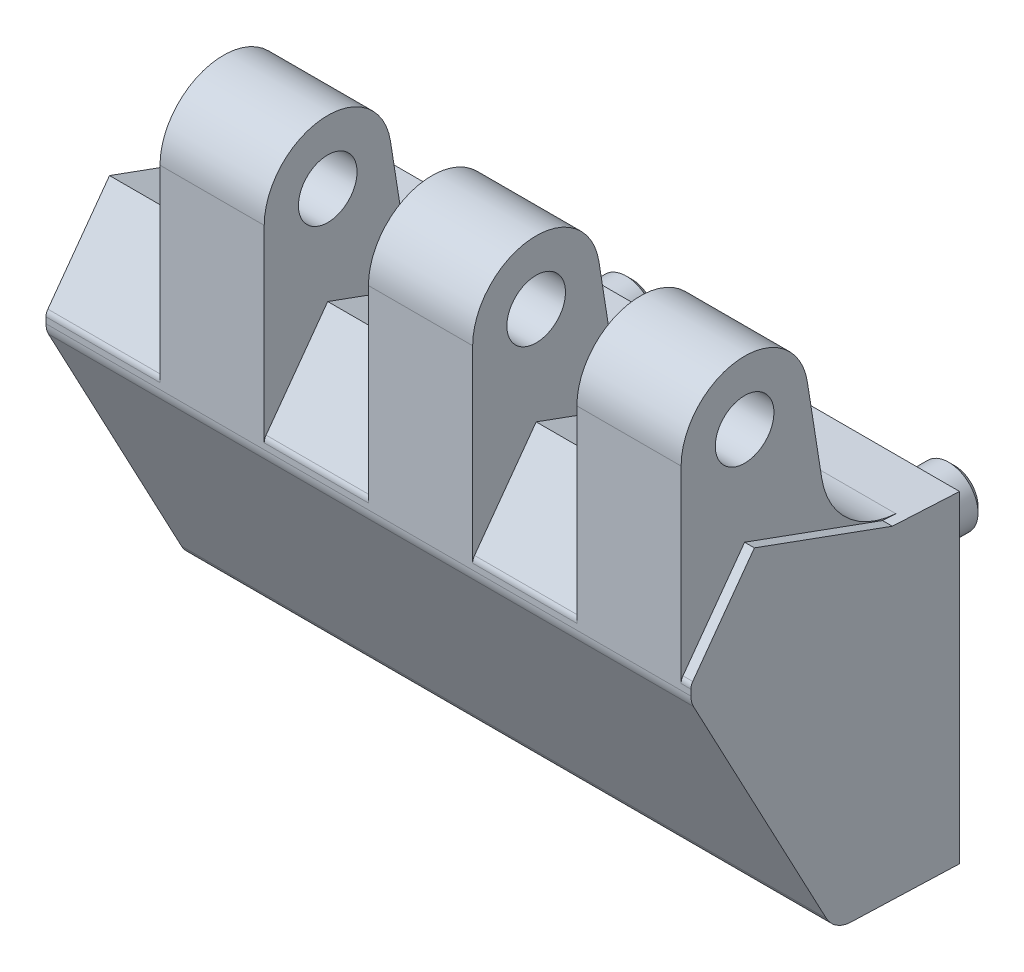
ISO-10303-21;
HEADER;
FILE_DESCRIPTION(('STEP AP214'),'2;1');
FILE_NAME('part.step','',(''),(''),'','','');
FILE_SCHEMA(('AUTOMOTIVE_DESIGN { 1 0 10303 214 1 1 1 1 }'));
ENDSEC;
DATA;
#1=APPLICATION_CONTEXT('core data for automotive mechanical design processes');
#2=APPLICATION_PROTOCOL_DEFINITION('international standard','automotive_design',2000,#1);
#3=PRODUCT_CONTEXT('',#1,'mechanical');
#4=PRODUCT('Part','Part','',(#3));
#5=PRODUCT_RELATED_PRODUCT_CATEGORY('part','',(#4));
#6=PRODUCT_DEFINITION_FORMATION('','',#4);
#7=PRODUCT_DEFINITION_CONTEXT('part definition',#1,'design');
#8=PRODUCT_DEFINITION('design','',#6,#7);
#9=PRODUCT_DEFINITION_SHAPE('','',#8);
#10=(LENGTH_UNIT() NAMED_UNIT(*) SI_UNIT(.MILLI.,.METRE.));
#11=(NAMED_UNIT(*) PLANE_ANGLE_UNIT() SI_UNIT($,.RADIAN.));
#12=(NAMED_UNIT(*) SI_UNIT($,.STERADIAN.) SOLID_ANGLE_UNIT());
#13=UNCERTAINTY_MEASURE_WITH_UNIT(LENGTH_MEASURE(1.E-05),#10,'distance_accuracy_value','');
#14=(GEOMETRIC_REPRESENTATION_CONTEXT(3) GLOBAL_UNCERTAINTY_ASSIGNED_CONTEXT((#13)) GLOBAL_UNIT_ASSIGNED_CONTEXT((#10,
#11,#12)) REPRESENTATION_CONTEXT('',''));
#15=CARTESIAN_POINT('',(0.,0.,0.));
#16=DIRECTION('',(0.,0.,1.));
#17=DIRECTION('',(1.,0.,0.));
#18=AXIS2_PLACEMENT_3D('',#15,#16,#17);
#19=CARTESIAN_POINT('',(-16.5,16.35,0.));
#20=DIRECTION('',(0.,0.998629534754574,-0.0523359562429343));
#21=DIRECTION('',(0.,0.0523359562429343,0.998629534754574));
#22=AXIS2_PLACEMENT_3D('',#19,#20,#21);
#23=PLANE('',#22);
#24=DIRECTION('',(-1.,0.,0.));
#25=VECTOR('',#24,1.);
#26=CARTESIAN_POINT('',(48.5,16.6393206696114,5.520567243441));
#27=LINE('',#26,#25);
#28=CARTESIAN_POINT('',(37.833333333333,16.6393206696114,5.52056724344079));
#29=VERTEX_POINT('',#28);
#30=CARTESIAN_POINT('',(48.5,16.6393206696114,5.520567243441));
#31=VERTEX_POINT('',#30);
#32=EDGE_CURVE('E29',#29,#31,#27,.F.);
#33=ORIENTED_EDGE('',*,*,#32,.T.);
#34=DIRECTION('',(0.,0.0523359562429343,0.998629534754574));
#35=VECTOR('',#34,1.);
#36=CARTESIAN_POINT('',(48.5,16.35,0.));
#37=LINE('',#36,#35);
#38=CARTESIAN_POINT('',(48.5,16.71068751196,6.8823277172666));
#39=VERTEX_POINT('',#38);
#40=EDGE_CURVE('E305',#31,#39,#37,.T.);
#41=ORIENTED_EDGE('',*,*,#40,.T.);
#42=DIRECTION('',(1.,0.,0.));
#43=VECTOR('',#42,1.);
#44=CARTESIAN_POINT('',(-16.5,16.71068751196,6.8823277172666));
#45=LINE('',#44,#43);
#46=CARTESIAN_POINT('',(49.5,16.71068751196,6.8823277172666));
#47=VERTEX_POINT('',#46);
#48=EDGE_CURVE('E508',#39,#47,#45,.T.);
#49=ORIENTED_EDGE('',*,*,#48,.T.);
#50=DIRECTION('',(0.,0.0523359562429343,0.998629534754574));
#51=VECTOR('',#50,1.);
#52=CARTESIAN_POINT('',(49.5,16.35,0.));
#53=LINE('',#52,#51);
#54=CARTESIAN_POINT('',(49.5,16.35,0.));
#55=VERTEX_POINT('',#54);
#56=EDGE_CURVE('E428',#55,#47,#53,.T.);
#57=ORIENTED_EDGE('',*,*,#56,.F.);
#58=DIRECTION('',(1.,0.,0.));
#59=VECTOR('',#58,1.);
#60=CARTESIAN_POINT('',(-16.5,16.35,0.));
#61=LINE('',#60,#59);
#62=CARTESIAN_POINT('',(-16.5,16.35,0.));
#63=VERTEX_POINT('',#62);
#64=EDGE_CURVE('E514',#63,#55,#61,.T.);
#65=ORIENTED_EDGE('',*,*,#64,.F.);
#66=DIRECTION('',(0.,0.0523359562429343,0.998629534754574));
#67=VECTOR('',#66,1.);
#68=CARTESIAN_POINT('',(-16.5,16.35,0.));
#69=LINE('',#68,#67);
#70=CARTESIAN_POINT('',(-16.5,16.71068751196,6.8823277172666));
#71=VERTEX_POINT('',#70);
#72=EDGE_CURVE('E458',#63,#71,#69,.T.);
#73=ORIENTED_EDGE('',*,*,#72,.T.);
#74=CARTESIAN_POINT('',(-4.833333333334,16.71068751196,6.8823277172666));
#75=VERTEX_POINT('',#74);
#76=EDGE_CURVE('E511',#71,#75,#45,.T.);
#77=ORIENTED_EDGE('',*,*,#76,.T.);
#78=DIRECTION('',(0.,0.0523359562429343,0.998629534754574));
#79=VECTOR('',#78,1.);
#80=CARTESIAN_POINT('',(-4.833333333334,16.35,0.));
#81=LINE('',#80,#79);
#82=CARTESIAN_POINT('',(-4.833333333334,16.6393206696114,5.52056724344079));
#83=VERTEX_POINT('',#82);
#84=EDGE_CURVE('E364',#83,#75,#81,.T.);
#85=ORIENTED_EDGE('',*,*,#84,.F.);
#86=DIRECTION('',(1.,0.,0.));
#87=VECTOR('',#86,1.);
#88=CARTESIAN_POINT('',(-4.833333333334,16.6393206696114,5.520567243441));
#89=LINE('',#88,#87);
#90=CARTESIAN_POINT('',(5.833333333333,16.6393206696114,5.52056724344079));
#91=VERTEX_POINT('',#90);
#92=EDGE_CURVE('E522',#91,#83,#89,.F.);
#93=ORIENTED_EDGE('',*,*,#92,.F.);
#94=DIRECTION('',(0.,0.0523359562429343,0.998629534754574));
#95=VECTOR('',#94,1.);
#96=CARTESIAN_POINT('',(5.833333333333,16.35,0.));
#97=LINE('',#96,#95);
#98=CARTESIAN_POINT('',(5.833333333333,16.71068751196,6.8823277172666));
#99=VERTEX_POINT('',#98);
#100=EDGE_CURVE('E355',#91,#99,#97,.T.);
#101=ORIENTED_EDGE('',*,*,#100,.T.);
#102=CARTESIAN_POINT('',(16.5,16.71068751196,6.8823277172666));
#103=VERTEX_POINT('',#102);
#104=EDGE_CURVE('E515',#99,#103,#45,.T.);
#105=ORIENTED_EDGE('',*,*,#104,.T.);
#106=DIRECTION('',(0.,0.0523359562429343,0.998629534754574));
#107=VECTOR('',#106,1.);
#108=CARTESIAN_POINT('',(16.5,16.35,0.));
#109=LINE('',#108,#107);
#110=CARTESIAN_POINT('',(16.5,16.6393206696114,5.52056724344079));
#111=VERTEX_POINT('',#110);
#112=EDGE_CURVE('E413',#111,#103,#109,.T.);
#113=ORIENTED_EDGE('',*,*,#112,.F.);
#114=DIRECTION('',(-1.,0.,0.));
#115=VECTOR('',#114,1.);
#116=CARTESIAN_POINT('',(27.166666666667,16.6393206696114,5.520567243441));
#117=LINE('',#116,#115);
#118=CARTESIAN_POINT('',(27.166666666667,16.6393206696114,5.520567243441));
#119=VERTEX_POINT('',#118);
#120=EDGE_CURVE('E520',#111,#119,#117,.F.);
#121=ORIENTED_EDGE('',*,*,#120,.T.);
#122=DIRECTION('',(0.,0.0523359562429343,0.998629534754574));
#123=VECTOR('',#122,1.);
#124=CARTESIAN_POINT('',(27.166666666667,16.35,0.));
#125=LINE('',#124,#123);
#126=CARTESIAN_POINT('',(27.166666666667,16.71068751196,6.8823277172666));
#127=VERTEX_POINT('',#126);
#128=EDGE_CURVE('E422',#119,#127,#125,.T.);
#129=ORIENTED_EDGE('',*,*,#128,.T.);
#130=CARTESIAN_POINT('',(37.833333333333,16.71068751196,6.8823277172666));
#131=VERTEX_POINT('',#130);
#132=EDGE_CURVE('E516',#127,#131,#45,.T.);
#133=ORIENTED_EDGE('',*,*,#132,.T.);
#134=DIRECTION('',(0.,0.0523359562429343,0.998629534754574));
#135=VECTOR('',#134,1.);
#136=CARTESIAN_POINT('',(37.833333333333,16.35,0.));
#137=LINE('',#136,#135);
#138=EDGE_CURVE('E34',#29,#131,#137,.T.);
#139=ORIENTED_EDGE('',*,*,#138,.F.);
#140=EDGE_LOOP('',(#33,#41,#49,#57,#65,#73,#77,#85,#93,#101,#105,#113,#121,#129,#133,#139));
#141=FACE_BOUND('',#140,.T.);
#142=ADVANCED_FACE('F14',(#141),#23,.T.);
#143=CARTESIAN_POINT('',(-16.5,16.71068751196,6.8823277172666));
#144=DIRECTION('',(0.,0.939692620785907,-0.342020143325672));
#145=DIRECTION('',(0.,0.342020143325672,0.939692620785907));
#146=AXIS2_PLACEMENT_3D('',#143,#144,#145);
#147=PLANE('',#146);
#148=ORIENTED_EDGE('',*,*,#48,.F.);
#149=DIRECTION('',(0.,0.342020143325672,0.939692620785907));
#150=VECTOR('',#149,1.);
#151=CARTESIAN_POINT('',(48.5,16.71068751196,6.8823277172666));
#152=LINE('',#151,#150);
#153=CARTESIAN_POINT('',(48.5,21.8491,21.));
#154=VERTEX_POINT('',#153);
#155=EDGE_CURVE('E303',#39,#154,#152,.T.);
#156=ORIENTED_EDGE('',*,*,#155,.T.);
#157=DIRECTION('',(1.,0.,0.));
#158=VECTOR('',#157,1.);
#159=CARTESIAN_POINT('',(-16.5,21.8491,21.));
#160=LINE('',#159,#158);
#161=CARTESIAN_POINT('',(49.5,21.8491,21.));
#162=VERTEX_POINT('',#161);
#163=EDGE_CURVE('E502',#154,#162,#160,.T.);
#164=ORIENTED_EDGE('',*,*,#163,.T.);
#165=DIRECTION('',(0.,0.342020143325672,0.939692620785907));
#166=VECTOR('',#165,1.);
#167=CARTESIAN_POINT('',(49.5,16.71068751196,6.8823277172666));
#168=LINE('',#167,#166);
#169=EDGE_CURVE('E431',#47,#162,#168,.T.);
#170=ORIENTED_EDGE('',*,*,#169,.F.);
#171=EDGE_LOOP('',(#148,#156,#164,#170));
#172=FACE_BOUND('',#171,.T.);
#173=ADVANCED_FACE('F625',(#172),#147,.T.);
#174=CARTESIAN_POINT('',(-16.5,21.8491,21.));
#175=DIRECTION('',(0.,0.587785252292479,0.809016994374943));
#176=DIRECTION('',(0.,-0.809016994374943,0.587785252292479));
#177=AXIS2_PLACEMENT_3D('',#174,#175,#176);
#178=PLANE('',#177);
#179=ORIENTED_EDGE('',*,*,#163,.F.);
#180=DIRECTION('',(0.,-0.809016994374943,0.587785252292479));
#181=VECTOR('',#180,1.);
#182=CARTESIAN_POINT('',(48.5,21.8491,21.));
#183=LINE('',#182,#181);
#184=CARTESIAN_POINT('',(48.5,13.165483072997,27.309016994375));
#185=VERTEX_POINT('',#184);
#186=EDGE_CURVE('E301',#154,#185,#183,.T.);
#187=ORIENTED_EDGE('',*,*,#186,.T.);
#188=DIRECTION('',(1.,0.,0.));
#189=VECTOR('',#188,1.);
#190=CARTESIAN_POINT('',(-16.5,13.165483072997,27.309016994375));
#191=LINE('',#190,#189);
#192=CARTESIAN_POINT('',(49.5,13.165483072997,27.309016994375));
#193=VERTEX_POINT('',#192);
#194=EDGE_CURVE('E496',#185,#193,#191,.T.);
#195=ORIENTED_EDGE('',*,*,#194,.T.);
#196=DIRECTION('',(0.,-0.809016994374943,0.587785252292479));
#197=VECTOR('',#196,1.);
#198=CARTESIAN_POINT('',(49.5,21.8491,21.));
#199=LINE('',#198,#197);
#200=EDGE_CURVE('E434',#162,#193,#199,.T.);
#201=ORIENTED_EDGE('',*,*,#200,.F.);
#202=EDGE_LOOP('',(#179,#187,#195,#201));
#203=FACE_BOUND('',#202,.T.);
#204=ADVANCED_FACE('F590',(#203),#178,.T.);
#205=CARTESIAN_POINT('',(-16.5,12.5776978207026,26.4999999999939));
#206=DIRECTION('',(1.,0.,0.));
#207=DIRECTION('',(0.,1.,0.));
#208=AXIS2_PLACEMENT_3D('',#205,#206,#207);
#209=CYLINDRICAL_SURFACE('',#208,1.0000000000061);
#210=ORIENTED_EDGE('',*,*,#194,.F.);
#211=CARTESIAN_POINT('',(48.5,12.5776978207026,26.4999999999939));
#212=DIRECTION('',(-1.,0.,0.));
#213=DIRECTION('',(0.,-1.,0.));
#214=AXIS2_PLACEMENT_3D('',#211,#212,#213);
#215=CIRCLE('',#214,1.0000000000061);
#216=CARTESIAN_POINT('',(48.5,12.577697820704,27.5));
#217=VERTEX_POINT('',#216);
#218=EDGE_CURVE('E299',#185,#217,#215,.F.);
#219=ORIENTED_EDGE('',*,*,#218,.T.);
#220=DIRECTION('',(1.,0.,0.));
#221=VECTOR('',#220,1.);
#222=CARTESIAN_POINT('',(-16.5,12.577697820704,27.5));
#223=LINE('',#222,#221);
#224=CARTESIAN_POINT('',(49.5,12.577697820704,27.5));
#225=VERTEX_POINT('',#224);
#226=EDGE_CURVE('E492',#217,#225,#223,.T.);
#227=ORIENTED_EDGE('',*,*,#226,.T.);
#228=CARTESIAN_POINT('',(49.5,12.5776978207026,26.4999999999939));
#229=DIRECTION('',(1.,0.,0.));
#230=DIRECTION('',(0.,1.,0.));
#231=AXIS2_PLACEMENT_3D('',#228,#229,#230);
#232=CIRCLE('',#231,1.0000000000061);
#233=EDGE_CURVE('E437',#193,#225,#232,.T.);
#234=ORIENTED_EDGE('',*,*,#233,.F.);
#235=EDGE_LOOP('',(#210,#219,#227,#234));
#236=FACE_BOUND('',#235,.T.);
#237=ADVANCED_FACE('F596',(#236),#209,.T.);
#238=ORIENTED_EDGE('',*,*,#104,.F.);
#239=DIRECTION('',(0.,0.342020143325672,0.939692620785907));
#240=VECTOR('',#239,1.);
#241=CARTESIAN_POINT('',(5.833333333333,16.71068751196,6.8823277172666));
#242=LINE('',#241,#240);
#243=CARTESIAN_POINT('',(5.833333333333,21.8491,21.));
#244=VERTEX_POINT('',#243);
#245=EDGE_CURVE('E352',#99,#244,#242,.T.);
#246=ORIENTED_EDGE('',*,*,#245,.T.);
#247=CARTESIAN_POINT('',(16.5,21.8491,21.));
#248=VERTEX_POINT('',#247);
#249=EDGE_CURVE('E509',#244,#248,#160,.T.);
#250=ORIENTED_EDGE('',*,*,#249,.T.);
#251=DIRECTION('',(0.,0.342020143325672,0.939692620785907));
#252=VECTOR('',#251,1.);
#253=CARTESIAN_POINT('',(16.5,16.71068751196,6.8823277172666));
#254=LINE('',#253,#252);
#255=EDGE_CURVE('E410',#103,#248,#254,.T.);
#256=ORIENTED_EDGE('',*,*,#255,.F.);
#257=EDGE_LOOP('',(#238,#246,#250,#256));
#258=FACE_BOUND('',#257,.T.);
#259=ADVANCED_FACE('F550',(#258),#147,.T.);
#260=ORIENTED_EDGE('',*,*,#249,.F.);
#261=DIRECTION('',(0.,-0.809016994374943,0.587785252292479));
#262=VECTOR('',#261,1.);
#263=CARTESIAN_POINT('',(5.833333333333,21.8491,21.));
#264=LINE('',#263,#262);
#265=CARTESIAN_POINT('',(5.833333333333,13.165483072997,27.309016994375));
#266=VERTEX_POINT('',#265);
#267=EDGE_CURVE('E349',#244,#266,#264,.T.);
#268=ORIENTED_EDGE('',*,*,#267,.T.);
#269=CARTESIAN_POINT('',(16.5,13.165483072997,27.309016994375));
#270=VERTEX_POINT('',#269);
#271=EDGE_CURVE('E503',#266,#270,#191,.T.);
#272=ORIENTED_EDGE('',*,*,#271,.T.);
#273=DIRECTION('',(0.,-0.809016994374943,0.587785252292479));
#274=VECTOR('',#273,1.);
#275=CARTESIAN_POINT('',(16.5,21.8491,21.));
#276=LINE('',#275,#274);
#277=EDGE_CURVE('E407',#248,#270,#276,.T.);
#278=ORIENTED_EDGE('',*,*,#277,.F.);
#279=EDGE_LOOP('',(#260,#268,#272,#278));
#280=FACE_BOUND('',#279,.T.);
#281=ADVANCED_FACE('F1048',(#280),#178,.T.);
#282=ORIENTED_EDGE('',*,*,#271,.F.);
#283=CARTESIAN_POINT('',(5.833333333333,12.5776978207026,26.4999999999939));
#284=DIRECTION('',(-1.,0.,0.));
#285=DIRECTION('',(0.,-1.,0.));
#286=AXIS2_PLACEMENT_3D('',#283,#284,#285);
#287=CIRCLE('',#286,1.0000000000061);
#288=CARTESIAN_POINT('',(5.833333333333,12.577697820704,27.5));
#289=VERTEX_POINT('',#288);
#290=EDGE_CURVE('E346',#266,#289,#287,.F.);
#291=ORIENTED_EDGE('',*,*,#290,.T.);
#292=CARTESIAN_POINT('',(16.5,12.577697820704,27.5));
#293=VERTEX_POINT('',#292);
#294=EDGE_CURVE('E497',#289,#293,#223,.T.);
#295=ORIENTED_EDGE('',*,*,#294,.T.);
#296=CARTESIAN_POINT('',(16.5,12.5776978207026,26.4999999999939));
#297=DIRECTION('',(-1.,0.,0.));
#298=DIRECTION('',(0.,-1.,0.));
#299=AXIS2_PLACEMENT_3D('',#296,#297,#298);
#300=CIRCLE('',#299,1.0000000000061);
#301=EDGE_CURVE('E404',#270,#293,#300,.F.);
#302=ORIENTED_EDGE('',*,*,#301,.F.);
#303=EDGE_LOOP('',(#282,#291,#295,#302));
#304=FACE_BOUND('',#303,.T.);
#305=ADVANCED_FACE('F604',(#304),#209,.T.);
#306=DIRECTION('',(0.,0.342020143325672,0.939692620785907));
#307=VECTOR('',#306,1.);
#308=CARTESIAN_POINT('',(37.833333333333,16.71068751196,6.8823277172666));
#309=LINE('',#308,#307);
#310=CARTESIAN_POINT('',(37.833333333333,21.8491,21.));
#311=VERTEX_POINT('',#310);
#312=EDGE_CURVE('E295',#131,#311,#309,.T.);
#313=ORIENTED_EDGE('',*,*,#312,.F.);
#314=ORIENTED_EDGE('',*,*,#132,.F.);
#315=DIRECTION('',(0.,0.342020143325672,0.939692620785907));
#316=VECTOR('',#315,1.);
#317=CARTESIAN_POINT('',(27.166666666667,16.71068751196,6.8823277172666));
#318=LINE('',#317,#316);
#319=CARTESIAN_POINT('',(27.166666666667,21.8491,21.));
#320=VERTEX_POINT('',#319);
#321=EDGE_CURVE('E420',#127,#320,#318,.T.);
#322=ORIENTED_EDGE('',*,*,#321,.T.);
#323=EDGE_CURVE('E510',#320,#311,#160,.T.);
#324=ORIENTED_EDGE('',*,*,#323,.T.);
#325=EDGE_LOOP('',(#313,#314,#322,#324));
#326=FACE_BOUND('',#325,.T.);
#327=ADVANCED_FACE('F577',(#326),#147,.T.);
#328=DIRECTION('',(0.,-0.809016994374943,0.587785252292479));
#329=VECTOR('',#328,1.);
#330=CARTESIAN_POINT('',(37.833333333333,21.8491,21.));
#331=LINE('',#330,#329);
#332=CARTESIAN_POINT('',(37.833333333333,13.165483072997,27.309016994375));
#333=VERTEX_POINT('',#332);
#334=EDGE_CURVE('E292',#311,#333,#331,.T.);
#335=ORIENTED_EDGE('',*,*,#334,.F.);
#336=ORIENTED_EDGE('',*,*,#323,.F.);
#337=DIRECTION('',(0.,-0.809016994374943,0.587785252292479));
#338=VECTOR('',#337,1.);
#339=CARTESIAN_POINT('',(27.166666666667,21.8491,21.));
#340=LINE('',#339,#338);
#341=CARTESIAN_POINT('',(27.166666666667,13.165483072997,27.309016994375));
#342=VERTEX_POINT('',#341);
#343=EDGE_CURVE('E418',#320,#342,#340,.T.);
#344=ORIENTED_EDGE('',*,*,#343,.T.);
#345=EDGE_CURVE('E504',#342,#333,#191,.T.);
#346=ORIENTED_EDGE('',*,*,#345,.T.);
#347=EDGE_LOOP('',(#335,#336,#344,#346));
#348=FACE_BOUND('',#347,.T.);
#349=ADVANCED_FACE('F582',(#348),#178,.T.);
#350=CARTESIAN_POINT('',(37.833333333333,12.5776978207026,26.4999999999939));
#351=DIRECTION('',(-1.,0.,0.));
#352=DIRECTION('',(0.,-1.,0.));
#353=AXIS2_PLACEMENT_3D('',#350,#351,#352);
#354=CIRCLE('',#353,1.0000000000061);
#355=CARTESIAN_POINT('',(37.833333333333,12.577697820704,27.5));
#356=VERTEX_POINT('',#355);
#357=EDGE_CURVE('E251',#333,#356,#354,.F.);
#358=ORIENTED_EDGE('',*,*,#357,.F.);
#359=ORIENTED_EDGE('',*,*,#345,.F.);
#360=CARTESIAN_POINT('',(27.166666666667,12.5776978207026,26.4999999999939));
#361=DIRECTION('',(-1.,0.,0.));
#362=DIRECTION('',(0.,-1.,0.));
#363=AXIS2_PLACEMENT_3D('',#360,#361,#362);
#364=CIRCLE('',#363,1.0000000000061);
#365=CARTESIAN_POINT('',(27.166666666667,12.577697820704,27.5));
#366=VERTEX_POINT('',#365);
#367=EDGE_CURVE('E416',#342,#366,#364,.F.);
#368=ORIENTED_EDGE('',*,*,#367,.T.);
#369=EDGE_CURVE('E498',#366,#356,#223,.T.);
#370=ORIENTED_EDGE('',*,*,#369,.T.);
#371=EDGE_LOOP('',(#358,#359,#368,#370));
#372=FACE_BOUND('',#371,.T.);
#373=ADVANCED_FACE('F643',(#372),#209,.T.);
#374=CARTESIAN_POINT('',(-16.5,-16.262685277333,11.091242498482));
#375=DIRECTION('',(0.,-0.999390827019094,0.0348994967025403));
#376=DIRECTION('',(0.,-0.0348994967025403,-0.999390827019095));
#377=AXIS2_PLACEMENT_3D('',#374,#375,#376);
#378=PLANE('',#377);
#379=DIRECTION('',(1.,0.,0.));
#380=VECTOR('',#379,1.);
#381=CARTESIAN_POINT('',(-16.5,-16.65,0.));
#382=LINE('',#381,#380);
#383=CARTESIAN_POINT('',(-16.5,-16.65,0.));
#384=VERTEX_POINT('',#383);
#385=CARTESIAN_POINT('',(49.5,-16.65,0.));
#386=VERTEX_POINT('',#385);
#387=EDGE_CURVE('E518',#384,#386,#382,.T.);
#388=ORIENTED_EDGE('',*,*,#387,.T.);
#389=DIRECTION('',(0.,-0.0348994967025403,-0.999390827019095));
#390=VECTOR('',#389,1.);
#391=CARTESIAN_POINT('',(49.5,-16.262685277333,11.091242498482));
#392=LINE('',#391,#390);
#393=CARTESIAN_POINT('',(49.5,-16.262685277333,11.091242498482));
#394=VERTEX_POINT('',#393);
#395=EDGE_CURVE('E424',#394,#386,#392,.T.);
#396=ORIENTED_EDGE('',*,*,#395,.F.);
#397=DIRECTION('',(1.,0.,0.));
#398=VECTOR('',#397,1.);
#399=CARTESIAN_POINT('',(-16.5,-16.262685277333,11.091242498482));
#400=LINE('',#399,#398);
#401=CARTESIAN_POINT('',(-16.5,-16.262685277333,11.091242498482));
#402=VERTEX_POINT('',#401);
#403=EDGE_CURVE('E482',#402,#394,#400,.T.);
#404=ORIENTED_EDGE('',*,*,#403,.F.);
#405=DIRECTION('',(0.,-0.0348994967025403,-0.999390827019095));
#406=VECTOR('',#405,1.);
#407=CARTESIAN_POINT('',(-16.5,-16.262685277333,11.091242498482));
#408=LINE('',#407,#406);
#409=EDGE_CURVE('E452',#402,#384,#408,.T.);
#410=ORIENTED_EDGE('',*,*,#409,.T.);
#411=EDGE_LOOP('',(#388,#396,#404,#410));
#412=FACE_BOUND('',#411,.T.);
#413=ADVANCED_FACE('F16',(#412),#378,.T.);
#414=CARTESIAN_POINT('',(-16.5,-16.65,0.));
#415=DIRECTION('',(0.,0.,-1.));
#416=DIRECTION('',(-1.,0.,0.));
#417=AXIS2_PLACEMENT_3D('',#414,#415,#416);
#418=PLANE('',#417);
#419=CARTESIAN_POINT('',(0.,0.,0.));
#420=DIRECTION('',(0.,0.,-1.));
#421=DIRECTION('',(-1.,0.,0.));
#422=AXIS2_PLACEMENT_3D('',#419,#420,#421);
#423=CIRCLE('',#422,3.);
#424=CARTESIAN_POINT('',(-3.,0.,0.));
#425=VERTEX_POINT('',#424);
#426=EDGE_CURVE('E9',#425,#425,#423,.T.);
#427=ORIENTED_EDGE('',*,*,#426,.F.);
#428=EDGE_LOOP('',(#427));
#429=FACE_BOUND('',#428,.T.);
#430=CARTESIAN_POINT('',(33.,0.,0.));
#431=DIRECTION('',(0.,0.,-1.));
#432=DIRECTION('',(-1.,0.,0.));
#433=AXIS2_PLACEMENT_3D('',#430,#431,#432);
#434=CIRCLE('',#433,3.);
#435=CARTESIAN_POINT('',(30.,0.,0.));
#436=VERTEX_POINT('',#435);
#437=EDGE_CURVE('E22',#436,#436,#434,.T.);
#438=ORIENTED_EDGE('',*,*,#437,.F.);
#439=EDGE_LOOP('',(#438));
#440=FACE_BOUND('',#439,.T.);
#441=ORIENTED_EDGE('',*,*,#64,.T.);
#442=DIRECTION('',(0.,1.,0.));
#443=VECTOR('',#442,1.);
#444=CARTESIAN_POINT('',(49.5,-16.65,0.));
#445=LINE('',#444,#443);
#446=EDGE_CURVE('E425',#386,#55,#445,.T.);
#447=ORIENTED_EDGE('',*,*,#446,.F.);
#448=ORIENTED_EDGE('',*,*,#387,.F.);
#449=DIRECTION('',(0.,1.,0.));
#450=VECTOR('',#449,1.);
#451=CARTESIAN_POINT('',(-16.5,-16.65,0.));
#452=LINE('',#451,#450);
#453=EDGE_CURVE('E455',#384,#63,#452,.T.);
#454=ORIENTED_EDGE('',*,*,#453,.T.);
#455=EDGE_LOOP('',(#441,#447,#448,#454));
#456=FACE_BOUND('',#455,.T.);
#457=ADVANCED_FACE('F529',(#429,#440,#456),#418,.T.);
#458=DIRECTION('',(0.,0.342020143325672,0.939692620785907));
#459=VECTOR('',#458,1.);
#460=CARTESIAN_POINT('',(-4.833333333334,16.71068751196,6.8823277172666));
#461=LINE('',#460,#459);
#462=CARTESIAN_POINT('',(-4.833333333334,21.8491,21.));
#463=VERTEX_POINT('',#462);
#464=EDGE_CURVE('E362',#75,#463,#461,.T.);
#465=ORIENTED_EDGE('',*,*,#464,.F.);
#466=ORIENTED_EDGE('',*,*,#76,.F.);
#467=DIRECTION('',(0.,0.342020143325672,0.939692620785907));
#468=VECTOR('',#467,1.);
#469=CARTESIAN_POINT('',(-16.5,16.71068751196,6.8823277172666));
#470=LINE('',#469,#468);
#471=CARTESIAN_POINT('',(-16.5,21.8491,21.));
#472=VERTEX_POINT('',#471);
#473=EDGE_CURVE('E461',#71,#472,#470,.T.);
#474=ORIENTED_EDGE('',*,*,#473,.T.);
#475=EDGE_CURVE('E505',#472,#463,#160,.T.);
#476=ORIENTED_EDGE('',*,*,#475,.T.);
#477=EDGE_LOOP('',(#465,#466,#474,#476));
#478=FACE_BOUND('',#477,.T.);
#479=ADVANCED_FACE('F532',(#478),#147,.T.);
#480=DIRECTION('',(0.,-0.809016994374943,0.587785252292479));
#481=VECTOR('',#480,1.);
#482=CARTESIAN_POINT('',(-4.833333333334,21.8491,21.));
#483=LINE('',#482,#481);
#484=CARTESIAN_POINT('',(-4.833333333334,13.165483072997,27.309016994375));
#485=VERTEX_POINT('',#484);
#486=EDGE_CURVE('E360',#463,#485,#483,.T.);
#487=ORIENTED_EDGE('',*,*,#486,.F.);
#488=ORIENTED_EDGE('',*,*,#475,.F.);
#489=DIRECTION('',(0.,-0.809016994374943,0.587785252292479));
#490=VECTOR('',#489,1.);
#491=CARTESIAN_POINT('',(-16.5,21.8491,21.));
#492=LINE('',#491,#490);
#493=CARTESIAN_POINT('',(-16.5,13.165483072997,27.309016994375));
#494=VERTEX_POINT('',#493);
#495=EDGE_CURVE('E464',#472,#494,#492,.T.);
#496=ORIENTED_EDGE('',*,*,#495,.T.);
#497=EDGE_CURVE('E499',#494,#485,#191,.T.);
#498=ORIENTED_EDGE('',*,*,#497,.T.);
#499=EDGE_LOOP('',(#487,#488,#496,#498));
#500=FACE_BOUND('',#499,.T.);
#501=ADVANCED_FACE('F634',(#500),#178,.T.);
#502=CARTESIAN_POINT('',(-4.833333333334,12.5776978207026,26.4999999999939));
#503=DIRECTION('',(-1.,0.,0.));
#504=DIRECTION('',(0.,-1.,0.));
#505=AXIS2_PLACEMENT_3D('',#502,#503,#504);
#506=CIRCLE('',#505,1.0000000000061);
#507=CARTESIAN_POINT('',(-4.833333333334,12.577697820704,27.5));
#508=VERTEX_POINT('',#507);
#509=EDGE_CURVE('E358',#485,#508,#506,.F.);
#510=ORIENTED_EDGE('',*,*,#509,.F.);
#511=ORIENTED_EDGE('',*,*,#497,.F.);
#512=CARTESIAN_POINT('',(-16.5,12.5776978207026,26.4999999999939));
#513=DIRECTION('',(1.,0.,0.));
#514=DIRECTION('',(0.,1.,0.));
#515=AXIS2_PLACEMENT_3D('',#512,#513,#514);
#516=CIRCLE('',#515,1.0000000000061);
#517=CARTESIAN_POINT('',(-16.5,12.577697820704,27.5));
#518=VERTEX_POINT('',#517);
#519=EDGE_CURVE('E467',#494,#518,#516,.T.);
#520=ORIENTED_EDGE('',*,*,#519,.T.);
#521=EDGE_CURVE('E493',#518,#508,#223,.T.);
#522=ORIENTED_EDGE('',*,*,#521,.T.);
#523=EDGE_LOOP('',(#510,#511,#520,#522));
#524=FACE_BOUND('',#523,.T.);
#525=ADVANCED_FACE('F638',(#524),#209,.T.);
#526=CARTESIAN_POINT('',(-16.5,12.577697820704,27.5));
#527=DIRECTION('',(0.,0.,1.));
#528=DIRECTION('',(1.,0.,0.));
#529=AXIS2_PLACEMENT_3D('',#526,#527,#528);
#530=PLANE('',#529);
#531=ORIENTED_EDGE('',*,*,#226,.F.);
#532=DIRECTION('',(0.,-1.,0.));
#533=VECTOR('',#532,1.);
#534=CARTESIAN_POINT('',(48.5,31.85,27.5));
#535=LINE('',#534,#533);
#536=CARTESIAN_POINT('',(48.5,31.85,27.5));
#537=VERTEX_POINT('',#536);
#538=EDGE_CURVE('E275',#537,#217,#535,.T.);
#539=ORIENTED_EDGE('',*,*,#538,.F.);
#540=DIRECTION('',(-1.,0.,0.));
#541=VECTOR('',#540,1.);
#542=CARTESIAN_POINT('',(48.5,31.85,27.5));
#543=LINE('',#542,#541);
#544=CARTESIAN_POINT('',(37.833333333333,31.85,27.5));
#545=VERTEX_POINT('',#544);
#546=EDGE_CURVE('E286',#537,#545,#543,.T.);
#547=ORIENTED_EDGE('',*,*,#546,.T.);
#548=DIRECTION('',(0.,-1.,0.));
#549=VECTOR('',#548,1.);
#550=CARTESIAN_POINT('',(37.833333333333,31.85,27.5));
#551=LINE('',#550,#549);
#552=EDGE_CURVE('E244',#545,#356,#551,.T.);
#553=ORIENTED_EDGE('',*,*,#552,.T.);
#554=ORIENTED_EDGE('',*,*,#369,.F.);
#555=DIRECTION('',(0.,-1.,0.));
#556=VECTOR('',#555,1.);
#557=CARTESIAN_POINT('',(27.166666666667,31.85,27.5));
#558=LINE('',#557,#556);
#559=CARTESIAN_POINT('',(27.166666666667,31.85,27.5));
#560=VERTEX_POINT('',#559);
#561=EDGE_CURVE('E383',#560,#366,#558,.T.);
#562=ORIENTED_EDGE('',*,*,#561,.F.);
#563=DIRECTION('',(-1.,0.,0.));
#564=VECTOR('',#563,1.);
#565=CARTESIAN_POINT('',(27.166666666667,31.85,27.5));
#566=LINE('',#565,#564);
#567=CARTESIAN_POINT('',(16.5,31.85,27.5));
#568=VERTEX_POINT('',#567);
#569=EDGE_CURVE('E395',#560,#568,#566,.T.);
#570=ORIENTED_EDGE('',*,*,#569,.T.);
#571=DIRECTION('',(0.,-1.,0.));
#572=VECTOR('',#571,1.);
#573=CARTESIAN_POINT('',(16.5,31.85,27.5));
#574=LINE('',#573,#572);
#575=EDGE_CURVE('E366',#568,#293,#574,.T.);
#576=ORIENTED_EDGE('',*,*,#575,.T.);
#577=ORIENTED_EDGE('',*,*,#294,.F.);
#578=DIRECTION('',(0.,-1.,0.));
#579=VECTOR('',#578,1.);
#580=CARTESIAN_POINT('',(5.833333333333,31.85,27.5));
#581=LINE('',#580,#579);
#582=CARTESIAN_POINT('',(5.833333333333,31.85,27.5));
#583=VERTEX_POINT('',#582);
#584=EDGE_CURVE('E307',#583,#289,#581,.T.);
#585=ORIENTED_EDGE('',*,*,#584,.F.);
#586=DIRECTION('',(1.,0.,0.));
#587=VECTOR('',#586,1.);
#588=CARTESIAN_POINT('',(-4.833333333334,31.85,27.5));
#589=LINE('',#588,#587);
#590=CARTESIAN_POINT('',(-4.833333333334,31.85,27.5));
#591=VERTEX_POINT('',#590);
#592=EDGE_CURVE('E339',#591,#583,#589,.T.);
#593=ORIENTED_EDGE('',*,*,#592,.F.);
#594=DIRECTION('',(0.,-1.,0.));
#595=VECTOR('',#594,1.);
#596=CARTESIAN_POINT('',(-4.833333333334,31.85,27.5));
#597=LINE('',#596,#595);
#598=EDGE_CURVE('E325',#591,#508,#597,.T.);
#599=ORIENTED_EDGE('',*,*,#598,.T.);
#600=ORIENTED_EDGE('',*,*,#521,.F.);
#601=DIRECTION('',(0.,-1.,0.));
#602=VECTOR('',#601,1.);
#603=CARTESIAN_POINT('',(-16.5,12.577697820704,27.5));
#604=LINE('',#603,#602);
#605=CARTESIAN_POINT('',(-16.5,11.963605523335,27.5));
#606=VERTEX_POINT('',#605);
#607=EDGE_CURVE('E470',#518,#606,#604,.T.);
#608=ORIENTED_EDGE('',*,*,#607,.T.);
#609=DIRECTION('',(1.,0.,0.));
#610=VECTOR('',#609,1.);
#611=CARTESIAN_POINT('',(-16.5,11.963605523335,27.5));
#612=LINE('',#611,#610);
#613=CARTESIAN_POINT('',(49.5,11.963605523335,27.5));
#614=VERTEX_POINT('',#613);
#615=EDGE_CURVE('E490',#606,#614,#612,.T.);
#616=ORIENTED_EDGE('',*,*,#615,.T.);
#617=DIRECTION('',(0.,-1.,0.));
#618=VECTOR('',#617,1.);
#619=CARTESIAN_POINT('',(49.5,12.577697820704,27.5));
#620=LINE('',#619,#618);
#621=EDGE_CURVE('E440',#225,#614,#620,.T.);
#622=ORIENTED_EDGE('',*,*,#621,.F.);
#623=EDGE_LOOP('',(#531,#539,#547,#553,#554,#562,#570,#576,#577,#585,#593,#599,#600,#608,#616,#622));
#624=FACE_BOUND('',#623,.T.);
#625=ADVANCED_FACE('F607',(#624),#530,.T.);
#626=CARTESIAN_POINT('',(-16.5,11.963605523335,25.2499999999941));
#627=DIRECTION('',(1.,0.,0.));
#628=DIRECTION('',(0.,1.,0.));
#629=AXIS2_PLACEMENT_3D('',#626,#627,#628);
#630=CYLINDRICAL_SURFACE('',#629,2.25000000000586);
#631=DIRECTION('',(1.,0.,0.));
#632=VECTOR('',#631,1.);
#633=CARTESIAN_POINT('',(-16.5,10.907294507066,27.236632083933));
#634=LINE('',#633,#632);
#635=CARTESIAN_POINT('',(-16.5,10.907294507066,27.236632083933));
#636=VERTEX_POINT('',#635);
#637=CARTESIAN_POINT('',(49.5,10.907294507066,27.236632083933));
#638=VERTEX_POINT('',#637);
#639=EDGE_CURVE('E488',#636,#638,#634,.T.);
#640=ORIENTED_EDGE('',*,*,#639,.T.);
#641=CARTESIAN_POINT('',(49.5,11.963605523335,25.2499999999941));
#642=DIRECTION('',(1.,0.,0.));
#643=DIRECTION('',(0.,1.,0.));
#644=AXIS2_PLACEMENT_3D('',#641,#642,#643);
#645=CIRCLE('',#644,2.25000000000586);
#646=EDGE_CURVE('E443',#614,#638,#645,.T.);
#647=ORIENTED_EDGE('',*,*,#646,.F.);
#648=ORIENTED_EDGE('',*,*,#615,.F.);
#649=CARTESIAN_POINT('',(-16.5,11.963605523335,25.2499999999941));
#650=DIRECTION('',(1.,0.,0.));
#651=DIRECTION('',(0.,1.,0.));
#652=AXIS2_PLACEMENT_3D('',#649,#650,#651);
#653=CIRCLE('',#652,2.25000000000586);
#654=EDGE_CURVE('E473',#606,#636,#653,.T.);
#655=ORIENTED_EDGE('',*,*,#654,.T.);
#656=EDGE_LOOP('',(#640,#647,#648,#655));
#657=FACE_BOUND('',#656,.T.);
#658=ADVANCED_FACE('F646',(#657),#630,.T.);
#659=CARTESIAN_POINT('',(-16.5,10.907294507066,27.236632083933));
#660=DIRECTION('',(0.,-0.469471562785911,0.882947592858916));
#661=DIRECTION('',(0.,-0.882947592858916,-0.469471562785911));
#662=AXIS2_PLACEMENT_3D('',#659,#660,#661);
#663=PLANE('',#662);
#664=DIRECTION('',(1.,0.,0.));
#665=VECTOR('',#664,1.);
#666=CARTESIAN_POINT('',(-16.5,-14.672927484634,13.635386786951));
#667=LINE('',#666,#665);
#668=CARTESIAN_POINT('',(-16.5,-14.672927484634,13.635386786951));
#669=VERTEX_POINT('',#668);
#670=CARTESIAN_POINT('',(49.5,-14.672927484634,13.635386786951));
#671=VERTEX_POINT('',#670);
#672=EDGE_CURVE('E486',#669,#671,#667,.T.);
#673=ORIENTED_EDGE('',*,*,#672,.T.);
#674=DIRECTION('',(0.,-0.882947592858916,-0.469471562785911));
#675=VECTOR('',#674,1.);
#676=CARTESIAN_POINT('',(49.5,10.907294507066,27.236632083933));
#677=LINE('',#676,#675);
#678=EDGE_CURVE('E446',#638,#671,#677,.T.);
#679=ORIENTED_EDGE('',*,*,#678,.F.);
#680=ORIENTED_EDGE('',*,*,#639,.F.);
#681=DIRECTION('',(0.,-0.882947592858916,-0.469471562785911));
#682=VECTOR('',#681,1.);
#683=CARTESIAN_POINT('',(-16.5,10.907294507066,27.236632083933));
#684=LINE('',#683,#682);
#685=EDGE_CURVE('E476',#636,#669,#684,.T.);
#686=ORIENTED_EDGE('',*,*,#685,.T.);
#687=EDGE_LOOP('',(#673,#679,#680,#686));
#688=FACE_BOUND('',#687,.T.);
#689=ADVANCED_FACE('F649',(#688),#663,.T.);
#690=CARTESIAN_POINT('',(-16.5,-13.2645127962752,10.9865440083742));
#691=DIRECTION('',(1.,0.,0.));
#692=DIRECTION('',(0.,1.,0.));
#693=AXIS2_PLACEMENT_3D('',#690,#691,#692);
#694=CYLINDRICAL_SURFACE('',#693,3.00000000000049);
#695=ORIENTED_EDGE('',*,*,#403,.T.);
#696=CARTESIAN_POINT('',(49.5,-13.2645127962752,10.9865440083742));
#697=DIRECTION('',(1.,0.,0.));
#698=DIRECTION('',(0.,1.,0.));
#699=AXIS2_PLACEMENT_3D('',#696,#697,#698);
#700=CIRCLE('',#699,3.00000000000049);
#701=EDGE_CURVE('E449',#671,#394,#700,.T.);
#702=ORIENTED_EDGE('',*,*,#701,.F.);
#703=ORIENTED_EDGE('',*,*,#672,.F.);
#704=CARTESIAN_POINT('',(-16.5,-13.2645127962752,10.9865440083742));
#705=DIRECTION('',(1.,0.,0.));
#706=DIRECTION('',(0.,1.,0.));
#707=AXIS2_PLACEMENT_3D('',#704,#705,#706);
#708=CIRCLE('',#707,3.00000000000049);
#709=EDGE_CURVE('E479',#669,#402,#708,.T.);
#710=ORIENTED_EDGE('',*,*,#709,.T.);
#711=EDGE_LOOP('',(#695,#702,#703,#710));
#712=FACE_BOUND('',#711,.T.);
#713=ADVANCED_FACE('F653',(#712),#694,.T.);
#714=CARTESIAN_POINT('',(-16.5,12.5776978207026,26.4999999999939));
#715=DIRECTION('',(1.,0.,0.));
#716=DIRECTION('',(0.,1.,0.));
#717=AXIS2_PLACEMENT_3D('',#714,#715,#716);
#718=PLANE('',#717);
#719=ORIENTED_EDGE('',*,*,#409,.F.);
#720=ORIENTED_EDGE('',*,*,#709,.F.);
#721=ORIENTED_EDGE('',*,*,#685,.F.);
#722=ORIENTED_EDGE('',*,*,#654,.F.);
#723=ORIENTED_EDGE('',*,*,#607,.F.);
#724=ORIENTED_EDGE('',*,*,#519,.F.);
#725=ORIENTED_EDGE('',*,*,#495,.F.);
#726=ORIENTED_EDGE('',*,*,#473,.F.);
#727=ORIENTED_EDGE('',*,*,#72,.F.);
#728=ORIENTED_EDGE('',*,*,#453,.F.);
#729=EDGE_LOOP('',(#719,#720,#721,#722,#723,#724,#725,#726,#727,#728));
#730=FACE_BOUND('',#729,.T.);
#731=ADVANCED_FACE('F657',(#730),#718,.F.);
#732=CARTESIAN_POINT('',(49.5,12.5776978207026,26.4999999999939));
#733=DIRECTION('',(1.,0.,0.));
#734=DIRECTION('',(0.,1.,0.));
#735=AXIS2_PLACEMENT_3D('',#732,#733,#734);
#736=PLANE('',#735);
#737=ORIENTED_EDGE('',*,*,#395,.T.);
#738=ORIENTED_EDGE('',*,*,#446,.T.);
#739=ORIENTED_EDGE('',*,*,#56,.T.);
#740=ORIENTED_EDGE('',*,*,#169,.T.);
#741=ORIENTED_EDGE('',*,*,#200,.T.);
#742=ORIENTED_EDGE('',*,*,#233,.T.);
#743=ORIENTED_EDGE('',*,*,#621,.T.);
#744=ORIENTED_EDGE('',*,*,#646,.T.);
#745=ORIENTED_EDGE('',*,*,#678,.T.);
#746=ORIENTED_EDGE('',*,*,#701,.T.);
#747=EDGE_LOOP('',(#737,#738,#739,#740,#741,#742,#743,#744,#745,#746));
#748=FACE_BOUND('',#747,.T.);
#749=ADVANCED_FACE('F539',(#748),#736,.T.);
#750=CARTESIAN_POINT('',(27.166666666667,24.870299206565,4.96066339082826));
#751=DIRECTION('',(-1.,0.,0.));
#752=DIRECTION('',(0.,-1.,0.));
#753=AXIS2_PLACEMENT_3D('',#750,#751,#752);
#754=CYLINDRICAL_SURFACE('',#753,8.2499999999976);
#755=ORIENTED_EDGE('',*,*,#120,.F.);
#756=CARTESIAN_POINT('',(16.5,24.870299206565,4.96066339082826));
#757=DIRECTION('',(-1.,0.,0.));
#758=DIRECTION('',(0.,1.,0.));
#759=AXIS2_PLACEMENT_3D('',#756,#757,#758);
#760=CIRCLE('',#759,8.2499999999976);
#761=CARTESIAN_POINT('',(16.5,23.5797148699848,13.109092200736));
#762=VERTEX_POINT('',#761);
#763=EDGE_CURVE('E367',#111,#762,#760,.T.);
#764=ORIENTED_EDGE('',*,*,#763,.T.);
#765=DIRECTION('',(-1.,0.,0.));
#766=VECTOR('',#765,1.);
#767=CARTESIAN_POINT('',(27.166666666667,23.5797148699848,13.109092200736));
#768=LINE('',#767,#766);
#769=CARTESIAN_POINT('',(27.166666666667,23.5797148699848,13.109092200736));
#770=VERTEX_POINT('',#769);
#771=EDGE_CURVE('E401',#770,#762,#768,.T.);
#772=ORIENTED_EDGE('',*,*,#771,.F.);
#773=CARTESIAN_POINT('',(27.166666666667,24.870299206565,4.96066339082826));
#774=DIRECTION('',(-1.,0.,0.));
#775=DIRECTION('',(0.,1.,0.));
#776=AXIS2_PLACEMENT_3D('',#773,#774,#775);
#777=CIRCLE('',#776,8.2499999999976);
#778=EDGE_CURVE('E384',#119,#770,#777,.T.);
#779=ORIENTED_EDGE('',*,*,#778,.F.);
#780=EDGE_LOOP('',(#755,#764,#772,#779));
#781=FACE_BOUND('',#780,.T.);
#782=ADVANCED_FACE('F561',(#781),#754,.F.);
#783=CARTESIAN_POINT('',(27.166666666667,23.5797148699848,13.109092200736));
#784=DIRECTION('',(0.,-0.156434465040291,0.987688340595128));
#785=DIRECTION('',(0.,-0.987688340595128,-0.156434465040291));
#786=AXIS2_PLACEMENT_3D('',#783,#784,#785);
#787=PLANE('',#786);
#788=DIRECTION('',(0.,0.987688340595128,0.156434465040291));
#789=VECTOR('',#788,1.);
#790=CARTESIAN_POINT('',(16.5,23.5797148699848,13.109092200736));
#791=LINE('',#790,#789);
#792=CARTESIAN_POINT('',(16.5,32.8668240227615,14.580025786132));
#793=VERTEX_POINT('',#792);
#794=EDGE_CURVE('E370',#762,#793,#791,.T.);
#795=ORIENTED_EDGE('',*,*,#794,.T.);
#796=DIRECTION('',(-1.,0.,0.));
#797=VECTOR('',#796,1.);
#798=CARTESIAN_POINT('',(27.166666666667,32.8668240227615,14.580025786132));
#799=LINE('',#798,#797);
#800=CARTESIAN_POINT('',(27.166666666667,32.8668240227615,14.580025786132));
#801=VERTEX_POINT('',#800);
#802=EDGE_CURVE('E398',#801,#793,#799,.T.);
#803=ORIENTED_EDGE('',*,*,#802,.F.);
#804=DIRECTION('',(0.,0.987688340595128,0.156434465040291));
#805=VECTOR('',#804,1.);
#806=CARTESIAN_POINT('',(27.166666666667,23.5797148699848,13.109092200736));
#807=LINE('',#806,#805);
#808=EDGE_CURVE('E386',#770,#801,#807,.T.);
#809=ORIENTED_EDGE('',*,*,#808,.F.);
#810=ORIENTED_EDGE('',*,*,#771,.T.);
#811=EDGE_LOOP('',(#795,#803,#809,#810));
#812=FACE_BOUND('',#811,.T.);
#813=ADVANCED_FACE('F565',(#812),#787,.F.);
#814=CARTESIAN_POINT('',(27.166666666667,31.85,21.));
#815=DIRECTION('',(-1.,0.,0.));
#816=DIRECTION('',(0.,-1.,0.));
#817=AXIS2_PLACEMENT_3D('',#814,#815,#816);
#818=CYLINDRICAL_SURFACE('',#817,6.49999999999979);
#819=CARTESIAN_POINT('',(16.5,31.85,21.));
#820=DIRECTION('',(1.,0.,0.));
#821=DIRECTION('',(0.,-1.,0.));
#822=AXIS2_PLACEMENT_3D('',#819,#820,#821);
#823=CIRCLE('',#822,6.49999999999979);
#824=EDGE_CURVE('E373',#793,#568,#823,.T.);
#825=ORIENTED_EDGE('',*,*,#824,.T.);
#826=ORIENTED_EDGE('',*,*,#569,.F.);
#827=CARTESIAN_POINT('',(27.166666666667,31.85,21.));
#828=DIRECTION('',(1.,0.,0.));
#829=DIRECTION('',(0.,-1.,0.));
#830=AXIS2_PLACEMENT_3D('',#827,#828,#829);
#831=CIRCLE('',#830,6.49999999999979);
#832=EDGE_CURVE('E388',#801,#560,#831,.T.);
#833=ORIENTED_EDGE('',*,*,#832,.F.);
#834=ORIENTED_EDGE('',*,*,#802,.T.);
#835=EDGE_LOOP('',(#825,#826,#833,#834));
#836=FACE_BOUND('',#835,.T.);
#837=ADVANCED_FACE('F611',(#836),#818,.T.);
#838=CARTESIAN_POINT('',(27.166666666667,31.85,21.));
#839=DIRECTION('',(-1.,0.,0.));
#840=DIRECTION('',(0.,-1.,0.));
#841=AXIS2_PLACEMENT_3D('',#838,#839,#840);
#842=CYLINDRICAL_SURFACE('',#841,3.);
#843=CARTESIAN_POINT('',(27.166666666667,31.85,21.));
#844=DIRECTION('',(1.,0.,0.));
#845=DIRECTION('',(0.,1.,0.));
#846=AXIS2_PLACEMENT_3D('',#843,#844,#845);
#847=CIRCLE('',#846,3.);
#848=CARTESIAN_POINT('',(27.166666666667,34.85,21.));
#849=VERTEX_POINT('',#848);
#850=EDGE_CURVE('E390',#849,#849,#847,.T.);
#851=ORIENTED_EDGE('',*,*,#850,.T.);
#852=EDGE_LOOP('',(#851));
#853=FACE_BOUND('',#852,.T.);
#854=CARTESIAN_POINT('',(16.5,31.85,21.));
#855=DIRECTION('',(1.,0.,0.));
#856=DIRECTION('',(0.,1.,0.));
#857=AXIS2_PLACEMENT_3D('',#854,#855,#856);
#858=CIRCLE('',#857,3.);
#859=CARTESIAN_POINT('',(16.5,34.85,21.));
#860=VERTEX_POINT('',#859);
#861=EDGE_CURVE('E376',#860,#860,#858,.T.);
#862=ORIENTED_EDGE('',*,*,#861,.F.);
#863=EDGE_LOOP('',(#862));
#864=FACE_BOUND('',#863,.T.);
#865=ADVANCED_FACE('F613',(#853,#864),#842,.F.);
#866=CARTESIAN_POINT('',(27.166666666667,24.870299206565,4.96066339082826));
#867=DIRECTION('',(-1.,0.,0.));
#868=DIRECTION('',(0.,-1.,0.));
#869=AXIS2_PLACEMENT_3D('',#866,#867,#868);
#870=PLANE('',#869);
#871=ORIENTED_EDGE('',*,*,#128,.F.);
#872=ORIENTED_EDGE('',*,*,#778,.T.);
#873=ORIENTED_EDGE('',*,*,#808,.T.);
#874=ORIENTED_EDGE('',*,*,#832,.T.);
#875=ORIENTED_EDGE('',*,*,#561,.T.);
#876=ORIENTED_EDGE('',*,*,#367,.F.);
#877=ORIENTED_EDGE('',*,*,#343,.F.);
#878=ORIENTED_EDGE('',*,*,#321,.F.);
#879=EDGE_LOOP('',(#871,#872,#873,#874,#875,#876,#877,#878));
#880=FACE_BOUND('',#879,.T.);
#881=ORIENTED_EDGE('',*,*,#850,.F.);
#882=EDGE_LOOP('',(#881));
#883=FACE_BOUND('',#882,.T.);
#884=ADVANCED_FACE('F570',(#880,#883),#870,.F.);
#885=CARTESIAN_POINT('',(16.5,24.870299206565,4.96066339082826));
#886=DIRECTION('',(-1.,0.,0.));
#887=DIRECTION('',(0.,-1.,0.));
#888=AXIS2_PLACEMENT_3D('',#885,#886,#887);
#889=PLANE('',#888);
#890=ORIENTED_EDGE('',*,*,#763,.F.);
#891=ORIENTED_EDGE('',*,*,#112,.T.);
#892=ORIENTED_EDGE('',*,*,#255,.T.);
#893=ORIENTED_EDGE('',*,*,#277,.T.);
#894=ORIENTED_EDGE('',*,*,#301,.T.);
#895=ORIENTED_EDGE('',*,*,#575,.F.);
#896=ORIENTED_EDGE('',*,*,#824,.F.);
#897=ORIENTED_EDGE('',*,*,#794,.F.);
#898=EDGE_LOOP('',(#890,#891,#892,#893,#894,#895,#896,#897));
#899=FACE_BOUND('',#898,.T.);
#900=ORIENTED_EDGE('',*,*,#861,.T.);
#901=EDGE_LOOP('',(#900));
#902=FACE_BOUND('',#901,.T.);
#903=ADVANCED_FACE('F555',(#899,#902),#889,.T.);
#904=CARTESIAN_POINT('',(-4.833333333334,24.870299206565,4.96066339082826));
#905=DIRECTION('',(1.,0.,0.));
#906=DIRECTION('',(0.,1.,0.));
#907=AXIS2_PLACEMENT_3D('',#904,#905,#906);
#908=CYLINDRICAL_SURFACE('',#907,8.2499999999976);
#909=CARTESIAN_POINT('',(5.833333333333,24.870299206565,4.96066339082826));
#910=DIRECTION('',(-1.,0.,0.));
#911=DIRECTION('',(0.,1.,0.));
#912=AXIS2_PLACEMENT_3D('',#909,#910,#911);
#913=CIRCLE('',#912,8.2499999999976);
#914=CARTESIAN_POINT('',(5.833333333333,23.5797148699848,13.109092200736));
#915=VERTEX_POINT('',#914);
#916=EDGE_CURVE('E308',#91,#915,#913,.T.);
#917=ORIENTED_EDGE('',*,*,#916,.F.);
#918=ORIENTED_EDGE('',*,*,#92,.T.);
#919=CARTESIAN_POINT('',(-4.833333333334,24.870299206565,4.96066339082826));
#920=DIRECTION('',(-1.,0.,0.));
#921=DIRECTION('',(0.,1.,0.));
#922=AXIS2_PLACEMENT_3D('',#919,#920,#921);
#923=CIRCLE('',#922,8.2499999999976);
#924=CARTESIAN_POINT('',(-4.833333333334,23.5797148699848,13.109092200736));
#925=VERTEX_POINT('',#924);
#926=EDGE_CURVE('E326',#83,#925,#923,.T.);
#927=ORIENTED_EDGE('',*,*,#926,.T.);
#928=DIRECTION('',(1.,0.,0.));
#929=VECTOR('',#928,1.);
#930=CARTESIAN_POINT('',(-4.833333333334,23.5797148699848,13.109092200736));
#931=LINE('',#930,#929);
#932=EDGE_CURVE('E343',#925,#915,#931,.T.);
#933=ORIENTED_EDGE('',*,*,#932,.T.);
#934=EDGE_LOOP('',(#917,#918,#927,#933));
#935=FACE_BOUND('',#934,.T.);
#936=ADVANCED_FACE('F809',(#935),#908,.F.);
#937=CARTESIAN_POINT('',(-4.833333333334,23.5797148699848,13.109092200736));
#938=DIRECTION('',(0.,0.156434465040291,-0.987688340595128));
#939=DIRECTION('',(0.,0.987688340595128,0.156434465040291));
#940=AXIS2_PLACEMENT_3D('',#937,#938,#939);
#941=PLANE('',#940);
#942=DIRECTION('',(0.,0.987688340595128,0.156434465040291));
#943=VECTOR('',#942,1.);
#944=CARTESIAN_POINT('',(5.833333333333,23.5797148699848,13.109092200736));
#945=LINE('',#944,#943);
#946=CARTESIAN_POINT('',(5.833333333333,32.8668240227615,14.580025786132));
#947=VERTEX_POINT('',#946);
#948=EDGE_CURVE('E311',#915,#947,#945,.T.);
#949=ORIENTED_EDGE('',*,*,#948,.F.);
#950=ORIENTED_EDGE('',*,*,#932,.F.);
#951=DIRECTION('',(0.,0.987688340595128,0.156434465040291));
#952=VECTOR('',#951,1.);
#953=CARTESIAN_POINT('',(-4.833333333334,23.5797148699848,13.109092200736));
#954=LINE('',#953,#952);
#955=CARTESIAN_POINT('',(-4.833333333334,32.8668240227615,14.580025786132));
#956=VERTEX_POINT('',#955);
#957=EDGE_CURVE('E328',#925,#956,#954,.T.);
#958=ORIENTED_EDGE('',*,*,#957,.T.);
#959=DIRECTION('',(1.,0.,0.));
#960=VECTOR('',#959,1.);
#961=CARTESIAN_POINT('',(-4.833333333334,32.8668240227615,14.580025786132));
#962=LINE('',#961,#960);
#963=EDGE_CURVE('E341',#956,#947,#962,.T.);
#964=ORIENTED_EDGE('',*,*,#963,.T.);
#965=EDGE_LOOP('',(#949,#950,#958,#964));
#966=FACE_BOUND('',#965,.T.);
#967=ADVANCED_FACE('F820',(#966),#941,.T.);
#968=CARTESIAN_POINT('',(-4.833333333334,31.85,21.));
#969=DIRECTION('',(1.,0.,0.));
#970=DIRECTION('',(0.,1.,0.));
#971=AXIS2_PLACEMENT_3D('',#968,#969,#970);
#972=CYLINDRICAL_SURFACE('',#971,6.49999999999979);
#973=CARTESIAN_POINT('',(5.833333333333,31.85,21.));
#974=DIRECTION('',(1.,0.,0.));
#975=DIRECTION('',(0.,-1.,0.));
#976=AXIS2_PLACEMENT_3D('',#973,#974,#975);
#977=CIRCLE('',#976,6.49999999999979);
#978=EDGE_CURVE('E315',#947,#583,#977,.T.);
#979=ORIENTED_EDGE('',*,*,#978,.F.);
#980=ORIENTED_EDGE('',*,*,#963,.F.);
#981=CARTESIAN_POINT('',(-4.833333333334,31.85,21.));
#982=DIRECTION('',(1.,0.,0.));
#983=DIRECTION('',(0.,-1.,0.));
#984=AXIS2_PLACEMENT_3D('',#981,#982,#983);
#985=CIRCLE('',#984,6.49999999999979);
#986=EDGE_CURVE('E331',#956,#591,#985,.T.);
#987=ORIENTED_EDGE('',*,*,#986,.T.);
#988=ORIENTED_EDGE('',*,*,#592,.T.);
#989=EDGE_LOOP('',(#979,#980,#987,#988));
#990=FACE_BOUND('',#989,.T.);
#991=ADVANCED_FACE('F832',(#990),#972,.T.);
#992=CARTESIAN_POINT('',(-4.833333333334,31.85,21.));
#993=DIRECTION('',(1.,0.,0.));
#994=DIRECTION('',(0.,1.,0.));
#995=AXIS2_PLACEMENT_3D('',#992,#993,#994);
#996=CYLINDRICAL_SURFACE('',#995,3.);
#997=CARTESIAN_POINT('',(-4.833333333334,31.85,21.));
#998=DIRECTION('',(1.,0.,0.));
#999=DIRECTION('',(0.,1.,0.));
#1000=AXIS2_PLACEMENT_3D('',#997,#998,#999);
#1001=CIRCLE('',#1000,3.);
#1002=CARTESIAN_POINT('',(-4.833333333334,34.85,21.));
#1003=VERTEX_POINT('',#1002);
#1004=EDGE_CURVE('E334',#1003,#1003,#1001,.T.);
#1005=ORIENTED_EDGE('',*,*,#1004,.F.);
#1006=EDGE_LOOP('',(#1005));
#1007=FACE_BOUND('',#1006,.T.);
#1008=CARTESIAN_POINT('',(5.833333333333,31.85,21.));
#1009=DIRECTION('',(1.,0.,0.));
#1010=DIRECTION('',(0.,1.,0.));
#1011=AXIS2_PLACEMENT_3D('',#1008,#1009,#1010);
#1012=CIRCLE('',#1011,3.);
#1013=CARTESIAN_POINT('',(5.833333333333,34.85,21.));
#1014=VERTEX_POINT('',#1013);
#1015=EDGE_CURVE('E319',#1014,#1014,#1012,.T.);
#1016=ORIENTED_EDGE('',*,*,#1015,.T.);
#1017=EDGE_LOOP('',(#1016));
#1018=FACE_BOUND('',#1017,.T.);
#1019=ADVANCED_FACE('F844',(#1007,#1018),#996,.F.);
#1020=CARTESIAN_POINT('',(-4.833333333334,24.870299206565,4.96066339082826));
#1021=DIRECTION('',(-1.,0.,0.));
#1022=DIRECTION('',(0.,-1.,0.));
#1023=AXIS2_PLACEMENT_3D('',#1020,#1021,#1022);
#1024=PLANE('',#1023);
#1025=ORIENTED_EDGE('',*,*,#926,.F.);
#1026=ORIENTED_EDGE('',*,*,#84,.T.);
#1027=ORIENTED_EDGE('',*,*,#464,.T.);
#1028=ORIENTED_EDGE('',*,*,#486,.T.);
#1029=ORIENTED_EDGE('',*,*,#509,.T.);
#1030=ORIENTED_EDGE('',*,*,#598,.F.);
#1031=ORIENTED_EDGE('',*,*,#986,.F.);
#1032=ORIENTED_EDGE('',*,*,#957,.F.);
#1033=EDGE_LOOP('',(#1025,#1026,#1027,#1028,#1029,#1030,#1031,#1032));
#1034=FACE_BOUND('',#1033,.T.);
#1035=ORIENTED_EDGE('',*,*,#1004,.T.);
#1036=EDGE_LOOP('',(#1035));
#1037=FACE_BOUND('',#1036,.T.);
#1038=ADVANCED_FACE('F856',(#1034,#1037),#1024,.T.);
#1039=CARTESIAN_POINT('',(5.833333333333,24.870299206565,4.96066339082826));
#1040=DIRECTION('',(-1.,0.,0.));
#1041=DIRECTION('',(0.,-1.,0.));
#1042=AXIS2_PLACEMENT_3D('',#1039,#1040,#1041);
#1043=PLANE('',#1042);
#1044=ORIENTED_EDGE('',*,*,#100,.F.);
#1045=ORIENTED_EDGE('',*,*,#916,.T.);
#1046=ORIENTED_EDGE('',*,*,#948,.T.);
#1047=ORIENTED_EDGE('',*,*,#978,.T.);
#1048=ORIENTED_EDGE('',*,*,#584,.T.);
#1049=ORIENTED_EDGE('',*,*,#290,.F.);
#1050=ORIENTED_EDGE('',*,*,#267,.F.);
#1051=ORIENTED_EDGE('',*,*,#245,.F.);
#1052=EDGE_LOOP('',(#1044,#1045,#1046,#1047,#1048,#1049,#1050,#1051));
#1053=FACE_BOUND('',#1052,.T.);
#1054=ORIENTED_EDGE('',*,*,#1015,.F.);
#1055=EDGE_LOOP('',(#1054));
#1056=FACE_BOUND('',#1055,.T.);
#1057=ADVANCED_FACE('F868',(#1053,#1056),#1043,.F.);
#1058=CARTESIAN_POINT('',(48.5,24.870299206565,4.96066339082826));
#1059=DIRECTION('',(-1.,0.,0.));
#1060=DIRECTION('',(0.,-1.,0.));
#1061=AXIS2_PLACEMENT_3D('',#1058,#1059,#1060);
#1062=CYLINDRICAL_SURFACE('',#1061,8.2499999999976);
#1063=ORIENTED_EDGE('',*,*,#32,.F.);
#1064=CARTESIAN_POINT('',(37.833333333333,24.870299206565,4.96066339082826));
#1065=DIRECTION('',(-1.,0.,0.));
#1066=DIRECTION('',(0.,1.,0.));
#1067=AXIS2_PLACEMENT_3D('',#1064,#1065,#1066);
#1068=CIRCLE('',#1067,8.2499999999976);
#1069=CARTESIAN_POINT('',(37.833333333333,23.5797148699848,13.109092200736));
#1070=VERTEX_POINT('',#1069);
#1071=EDGE_CURVE('E234',#29,#1070,#1068,.T.);
#1072=ORIENTED_EDGE('',*,*,#1071,.T.);
#1073=DIRECTION('',(-1.,0.,0.));
#1074=VECTOR('',#1073,1.);
#1075=CARTESIAN_POINT('',(48.5,23.5797148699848,13.109092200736));
#1076=LINE('',#1075,#1074);
#1077=CARTESIAN_POINT('',(48.5,23.5797148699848,13.109092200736));
#1078=VERTEX_POINT('',#1077);
#1079=EDGE_CURVE('E238',#1078,#1070,#1076,.T.);
#1080=ORIENTED_EDGE('',*,*,#1079,.F.);
#1081=CARTESIAN_POINT('',(48.5,24.870299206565,4.96066339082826));
#1082=DIRECTION('',(-1.,0.,0.));
#1083=DIRECTION('',(0.,1.,0.));
#1084=AXIS2_PLACEMENT_3D('',#1081,#1082,#1083);
#1085=CIRCLE('',#1084,8.2499999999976);
#1086=EDGE_CURVE('E276',#31,#1078,#1085,.T.);
#1087=ORIENTED_EDGE('',*,*,#1086,.F.);
#1088=EDGE_LOOP('',(#1063,#1072,#1080,#1087));
#1089=FACE_BOUND('',#1088,.T.);
#1090=ADVANCED_FACE('F236',(#1089),#1062,.F.);
#1091=CARTESIAN_POINT('',(48.5,23.5797148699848,13.109092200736));
#1092=DIRECTION('',(0.,-0.156434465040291,0.987688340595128));
#1093=DIRECTION('',(0.,-0.987688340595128,-0.156434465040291));
#1094=AXIS2_PLACEMENT_3D('',#1091,#1092,#1093);
#1095=PLANE('',#1094);
#1096=DIRECTION('',(0.,0.987688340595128,0.156434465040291));
#1097=VECTOR('',#1096,1.);
#1098=CARTESIAN_POINT('',(37.833333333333,23.5797148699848,13.109092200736));
#1099=LINE('',#1098,#1097);
#1100=CARTESIAN_POINT('',(37.833333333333,32.8668240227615,14.580025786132));
#1101=VERTEX_POINT('',#1100);
#1102=EDGE_CURVE('E243',#1070,#1101,#1099,.T.);
#1103=ORIENTED_EDGE('',*,*,#1102,.T.);
#1104=DIRECTION('',(-1.,0.,0.));
#1105=VECTOR('',#1104,1.);
#1106=CARTESIAN_POINT('',(48.5,32.8668240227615,14.580025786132));
#1107=LINE('',#1106,#1105);
#1108=CARTESIAN_POINT('',(48.5,32.8668240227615,14.580025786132));
#1109=VERTEX_POINT('',#1108);
#1110=EDGE_CURVE('E252',#1109,#1101,#1107,.T.);
#1111=ORIENTED_EDGE('',*,*,#1110,.F.);
#1112=DIRECTION('',(0.,0.987688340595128,0.156434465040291));
#1113=VECTOR('',#1112,1.);
#1114=CARTESIAN_POINT('',(48.5,23.5797148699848,13.109092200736));
#1115=LINE('',#1114,#1113);
#1116=EDGE_CURVE('E250',#1078,#1109,#1115,.T.);
#1117=ORIENTED_EDGE('',*,*,#1116,.F.);
#1118=ORIENTED_EDGE('',*,*,#1079,.T.);
#1119=EDGE_LOOP('',(#1103,#1111,#1117,#1118));
#1120=FACE_BOUND('',#1119,.T.);
#1121=ADVANCED_FACE('F247',(#1120),#1095,.F.);
#1122=CARTESIAN_POINT('',(48.5,31.85,21.));
#1123=DIRECTION('',(-1.,0.,0.));
#1124=DIRECTION('',(0.,-1.,0.));
#1125=AXIS2_PLACEMENT_3D('',#1122,#1123,#1124);
#1126=CYLINDRICAL_SURFACE('',#1125,6.49999999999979);
#1127=CARTESIAN_POINT('',(37.833333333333,31.85,21.));
#1128=DIRECTION('',(1.,0.,0.));
#1129=DIRECTION('',(0.,-1.,0.));
#1130=AXIS2_PLACEMENT_3D('',#1127,#1128,#1129);
#1131=CIRCLE('',#1130,6.49999999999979);
#1132=EDGE_CURVE('E258',#1101,#545,#1131,.T.);
#1133=ORIENTED_EDGE('',*,*,#1132,.T.);
#1134=ORIENTED_EDGE('',*,*,#546,.F.);
#1135=CARTESIAN_POINT('',(48.5,31.85,21.));
#1136=DIRECTION('',(1.,0.,0.));
#1137=DIRECTION('',(0.,-1.,0.));
#1138=AXIS2_PLACEMENT_3D('',#1135,#1136,#1137);
#1139=CIRCLE('',#1138,6.49999999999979);
#1140=EDGE_CURVE('E279',#1109,#537,#1139,.T.);
#1141=ORIENTED_EDGE('',*,*,#1140,.F.);
#1142=ORIENTED_EDGE('',*,*,#1110,.T.);
#1143=EDGE_LOOP('',(#1133,#1134,#1141,#1142));
#1144=FACE_BOUND('',#1143,.T.);
#1145=ADVANCED_FACE('F901',(#1144),#1126,.T.);
#1146=CARTESIAN_POINT('',(48.5,31.85,21.));
#1147=DIRECTION('',(-1.,0.,0.));
#1148=DIRECTION('',(0.,-1.,0.));
#1149=AXIS2_PLACEMENT_3D('',#1146,#1147,#1148);
#1150=CYLINDRICAL_SURFACE('',#1149,3.);
#1151=CARTESIAN_POINT('',(48.5,31.85,21.));
#1152=DIRECTION('',(1.,0.,0.));
#1153=DIRECTION('',(0.,1.,0.));
#1154=AXIS2_PLACEMENT_3D('',#1151,#1152,#1153);
#1155=CIRCLE('',#1154,3.);
#1156=CARTESIAN_POINT('',(48.5,34.85,21.));
#1157=VERTEX_POINT('',#1156);
#1158=EDGE_CURVE('E281',#1157,#1157,#1155,.T.);
#1159=ORIENTED_EDGE('',*,*,#1158,.T.);
#1160=EDGE_LOOP('',(#1159));
#1161=FACE_BOUND('',#1160,.T.);
#1162=CARTESIAN_POINT('',(37.833333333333,31.85,21.));
#1163=DIRECTION('',(1.,0.,0.));
#1164=DIRECTION('',(0.,1.,0.));
#1165=AXIS2_PLACEMENT_3D('',#1162,#1163,#1164);
#1166=CIRCLE('',#1165,3.);
#1167=CARTESIAN_POINT('',(37.833333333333,34.85,21.));
#1168=VERTEX_POINT('',#1167);
#1169=EDGE_CURVE('E264',#1168,#1168,#1166,.T.);
#1170=ORIENTED_EDGE('',*,*,#1169,.F.);
#1171=EDGE_LOOP('',(#1170));
#1172=FACE_BOUND('',#1171,.T.);
#1173=ADVANCED_FACE('F912',(#1161,#1172),#1150,.F.);
#1174=CARTESIAN_POINT('',(48.5,24.870299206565,4.96066339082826));
#1175=DIRECTION('',(-1.,0.,0.));
#1176=DIRECTION('',(0.,-1.,0.));
#1177=AXIS2_PLACEMENT_3D('',#1174,#1175,#1176);
#1178=PLANE('',#1177);
#1179=ORIENTED_EDGE('',*,*,#40,.F.);
#1180=ORIENTED_EDGE('',*,*,#1086,.T.);
#1181=ORIENTED_EDGE('',*,*,#1116,.T.);
#1182=ORIENTED_EDGE('',*,*,#1140,.T.);
#1183=ORIENTED_EDGE('',*,*,#538,.T.);
#1184=ORIENTED_EDGE('',*,*,#218,.F.);
#1185=ORIENTED_EDGE('',*,*,#186,.F.);
#1186=ORIENTED_EDGE('',*,*,#155,.F.);
#1187=EDGE_LOOP('',(#1179,#1180,#1181,#1182,#1183,#1184,#1185,#1186));
#1188=FACE_BOUND('',#1187,.T.);
#1189=ORIENTED_EDGE('',*,*,#1158,.F.);
#1190=EDGE_LOOP('',(#1189));
#1191=FACE_BOUND('',#1190,.T.);
#1192=ADVANCED_FACE('F924',(#1188,#1191),#1178,.F.);
#1193=CARTESIAN_POINT('',(37.833333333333,24.870299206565,4.96066339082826));
#1194=DIRECTION('',(-1.,0.,0.));
#1195=DIRECTION('',(0.,-1.,0.));
#1196=AXIS2_PLACEMENT_3D('',#1193,#1194,#1195);
#1197=PLANE('',#1196);
#1198=ORIENTED_EDGE('',*,*,#1071,.F.);
#1199=ORIENTED_EDGE('',*,*,#138,.T.);
#1200=ORIENTED_EDGE('',*,*,#312,.T.);
#1201=ORIENTED_EDGE('',*,*,#334,.T.);
#1202=ORIENTED_EDGE('',*,*,#357,.T.);
#1203=ORIENTED_EDGE('',*,*,#552,.F.);
#1204=ORIENTED_EDGE('',*,*,#1132,.F.);
#1205=ORIENTED_EDGE('',*,*,#1102,.F.);
#1206=EDGE_LOOP('',(#1198,#1199,#1200,#1201,#1202,#1203,#1204,#1205));
#1207=FACE_BOUND('',#1206,.T.);
#1208=ORIENTED_EDGE('',*,*,#1169,.T.);
#1209=EDGE_LOOP('',(#1208));
#1210=FACE_BOUND('',#1209,.T.);
#1211=ADVANCED_FACE('F255',(#1207,#1210),#1197,.T.);
#1212=CARTESIAN_POINT('',(33.,0.,-16.));
#1213=DIRECTION('',(0.,0.,1.));
#1214=DIRECTION('',(0.,-1.,0.));
#1215=AXIS2_PLACEMENT_3D('',#1212,#1213,#1214);
#1216=CYLINDRICAL_SURFACE('',#1215,3.);
#1217=CARTESIAN_POINT('',(33.,0.,-15.3865));
#1218=DIRECTION('',(0.,0.,1.));
#1219=DIRECTION('',(0.,-1.,0.));
#1220=AXIS2_PLACEMENT_3D('',#1217,#1218,#1219);
#1221=CIRCLE('',#1220,3.);
#1222=CARTESIAN_POINT('',(33.,-3.,-15.3865));
#1223=VERTEX_POINT('',#1222);
#1224=EDGE_CURVE('E271',#1223,#1223,#1221,.T.);
#1225=ORIENTED_EDGE('',*,*,#1224,.T.);
#1226=EDGE_LOOP('',(#1225));
#1227=FACE_BOUND('',#1226,.T.);
#1228=ORIENTED_EDGE('',*,*,#437,.T.);
#1229=EDGE_LOOP('',(#1228));
#1230=FACE_BOUND('',#1229,.T.);
#1231=ADVANCED_FACE('F527',(#1227,#1230),#1216,.T.);
#1232=CARTESIAN_POINT('',(33.,0.,-15.3865));
#1233=DIRECTION('',(0.,0.,1.));
#1234=DIRECTION('',(0.,-1.,0.));
#1235=AXIS2_PLACEMENT_3D('',#1232,#1233,#1234);
#1236=CONICAL_SURFACE('',#1235,3.,0.78539816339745);
#1237=CARTESIAN_POINT('',(33.,0.,-16.));
#1238=DIRECTION('',(0.,0.,1.));
#1239=DIRECTION('',(0.,-1.,0.));
#1240=AXIS2_PLACEMENT_3D('',#1237,#1238,#1239);
#1241=CIRCLE('',#1240,2.3865);
#1242=CARTESIAN_POINT('',(33.,-2.3865,-16.));
#1243=VERTEX_POINT('',#1242);
#1244=EDGE_CURVE('E1516',#1243,#1243,#1241,.T.);
#1245=ORIENTED_EDGE('',*,*,#1244,.T.);
#1246=EDGE_LOOP('',(#1245));
#1247=FACE_BOUND('',#1246,.T.);
#1248=ORIENTED_EDGE('',*,*,#1224,.F.);
#1249=EDGE_LOOP('',(#1248));
#1250=FACE_BOUND('',#1249,.T.);
#1251=ADVANCED_FACE('F957',(#1247,#1250),#1236,.T.);
#1252=CARTESIAN_POINT('',(30.6135,0.,-16.));
#1253=DIRECTION('',(0.,0.,-1.));
#1254=DIRECTION('',(0.,1.,0.));
#1255=AXIS2_PLACEMENT_3D('',#1252,#1253,#1254);
#1256=PLANE('',#1255);
#1257=ORIENTED_EDGE('',*,*,#1244,.F.);
#1258=EDGE_LOOP('',(#1257));
#1259=FACE_BOUND('',#1258,.T.);
#1260=ADVANCED_FACE('F969',(#1259),#1256,.T.);
#1261=CARTESIAN_POINT('',(0.,0.,-16.));
#1262=DIRECTION('',(0.,0.,1.));
#1263=DIRECTION('',(0.,-1.,0.));
#1264=AXIS2_PLACEMENT_3D('',#1261,#1262,#1263);
#1265=CYLINDRICAL_SURFACE('',#1264,3.);
#1266=CARTESIAN_POINT('',(0.,0.,-15.3865));
#1267=DIRECTION('',(0.,0.,1.));
#1268=DIRECTION('',(0.,-1.,0.));
#1269=AXIS2_PLACEMENT_3D('',#1266,#1267,#1268);
#1270=CIRCLE('',#1269,3.);
#1271=CARTESIAN_POINT('',(0.,-3.,-15.3865));
#1272=VERTEX_POINT('',#1271);
#1273=EDGE_CURVE('E1513',#1272,#1272,#1270,.T.);
#1274=ORIENTED_EDGE('',*,*,#1273,.T.);
#1275=EDGE_LOOP('',(#1274));
#1276=FACE_BOUND('',#1275,.T.);
#1277=ORIENTED_EDGE('',*,*,#426,.T.);
#1278=EDGE_LOOP('',(#1277));
#1279=FACE_BOUND('',#1278,.T.);
#1280=ADVANCED_FACE('F981',(#1276,#1279),#1265,.T.);
#1281=CARTESIAN_POINT('',(0.,0.,-15.3865));
#1282=DIRECTION('',(0.,0.,1.));
#1283=DIRECTION('',(0.,-1.,0.));
#1284=AXIS2_PLACEMENT_3D('',#1281,#1282,#1283);
#1285=CONICAL_SURFACE('',#1284,3.,0.785398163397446);
#1286=CARTESIAN_POINT('',(0.,0.,-16.));
#1287=DIRECTION('',(0.,0.,1.));
#1288=DIRECTION('',(0.,-1.,0.));
#1289=AXIS2_PLACEMENT_3D('',#1286,#1287,#1288);
#1290=CIRCLE('',#1289,2.3865);
#1291=CARTESIAN_POINT('',(0.,-2.3865,-16.));
#1292=VERTEX_POINT('',#1291);
#1293=EDGE_CURVE('E1512',#1292,#1292,#1290,.T.);
#1294=ORIENTED_EDGE('',*,*,#1293,.T.);
#1295=EDGE_LOOP('',(#1294));
#1296=FACE_BOUND('',#1295,.T.);
#1297=ORIENTED_EDGE('',*,*,#1273,.F.);
#1298=EDGE_LOOP('',(#1297));
#1299=FACE_BOUND('',#1298,.T.);
#1300=ADVANCED_FACE('F993',(#1296,#1299),#1285,.T.);
#1301=CARTESIAN_POINT('',(-2.3865,0.,-16.));
#1302=DIRECTION('',(0.,0.,-1.));
#1303=DIRECTION('',(0.,1.,0.));
#1304=AXIS2_PLACEMENT_3D('',#1301,#1302,#1303);
#1305=PLANE('',#1304);
#1306=ORIENTED_EDGE('',*,*,#1293,.F.);
#1307=EDGE_LOOP('',(#1306));
#1308=FACE_BOUND('',#1307,.T.);
#1309=ADVANCED_FACE('F1005',(#1308),#1305,.T.);
#1310=CLOSED_SHELL('',(#142,#173,#204,#237,#259,#281,#305,#327,#349,#373,#413,#457,#479,#501,
#525,#625,#658,#689,#713,#731,#749,#782,#813,#837,#865,#884,#903,#936,#967,#991,#1019,#1038,
#1057,#1090,#1121,#1145,#1173,#1192,#1211,#1231,#1251,#1260,#1280,#1300,#1309));
#1311=MANIFOLD_SOLID_BREP('B1',#1310);
#1312=ADVANCED_BREP_SHAPE_REPRESENTATION('',(#18,#1311),#14);
#1313=SHAPE_DEFINITION_REPRESENTATION(#9,#1312);
ENDSEC;
END-ISO-10303-21;
